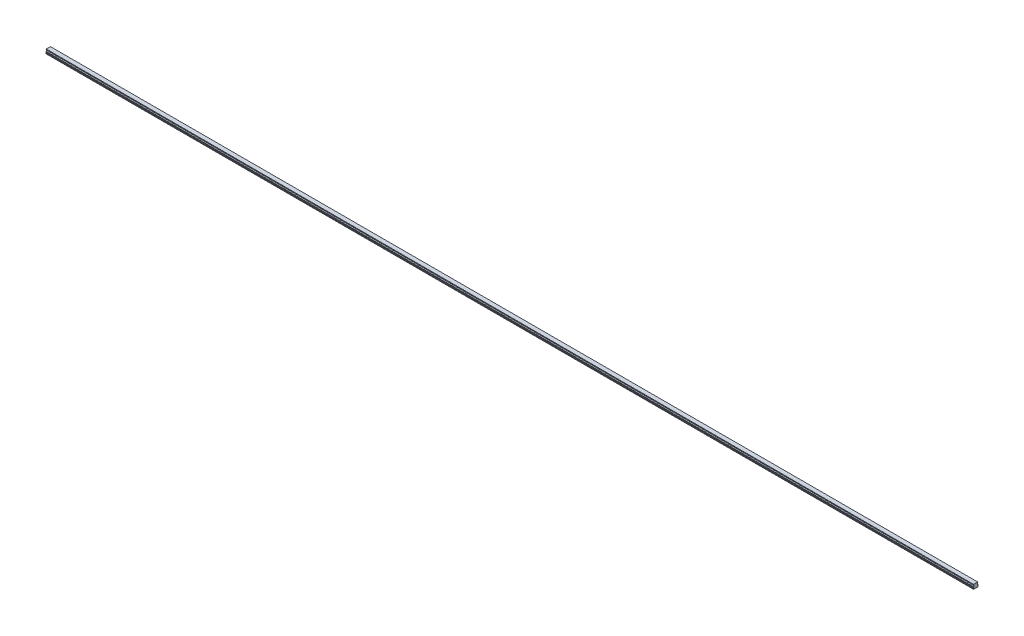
from build123d import *

# Parameters (mm, degrees)
BOSS_EXTRUDE1_DEPTH        = 2940
SKETCH3_R                  = 2.5
SKETCH3_R_2                = 2.1
CUT_EXTRUDE3_DEPTH         = 7
SKETCH3_2_R                = 2.1
CUT_EXTRUDE4_DEPTH         = 9.5
CHAMFER1_SIZE              = 0.4
LPATTERN2_COUNT            = 49
LPATTERN2_PITCH            = 60
CHAMFER1_OF_LPATTERN2_SIZE = 0.4


with BuildPart() as part:
    # Sketch1 → Boss-Extrude1 (new body)
    with BuildSketch(Plane(origin=(0, 0, 0), x_dir=(0, 0, -1), z_dir=(1, 0, 0))):
        with BuildLine():
            Line((6.59, 14), (-6.59, 14))
            Line((-6.59, 14), (-6.59, 13.15))
            Line((-6.59, 13.15), (-6.96, 12.356532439))
            Line((-6.96, 12.356532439), (-6.96, 11.435174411))
            ThreePointArc((-6.96, 11.435174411), (-5.25, 9.5), (-6.96, 7.564825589))
            Line((-6.96, 7.564825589), (-6.96, 6.643467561))
            Line((-6.96, 6.643467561), (-6.59, 5.85))
            Line((-6.59, 5.85), (-7.032116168, 4.2))
            Line((-7.032116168, 4.2), (-7.5, 3.929867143))
            Line((-7.5, 3.929867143), (-7.5, 1.4))
            Line((-7.5, 1.4), (-6.1, 0))
            Line((-6.1, 0), (-3.65, 0))
            Line((-3.65, 0), (-3.25, 0.4))
            Line((-3.25, 0.4), (3.25, 0.4))
            Line((3.25, 0.4), (3.65, 0))
            Line((3.65, 0), (6.1, 0))
            Line((6.1, 0), (7.5, 1.4))
            Line((7.5, 1.4), (7.5, 3.929867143))
            Line((7.5, 3.929867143), (7.032116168, 4.2))
            Line((7.032116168, 4.2), (6.59, 5.85))
            Line((6.59, 5.85), (6.96, 6.643467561))
            Line((6.96, 6.643467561), (6.96, 7.564825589))
            ThreePointArc((6.96, 7.564825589), (5.25, 9.5), (6.96, 11.435174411))
            Line((6.96, 11.435174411), (6.96, 12.356532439))
            Line((6.96, 12.356532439), (6.59, 13.15))
            Line((6.59, 13.15), (6.59, 14))
        make_face()
    extrude(amount=BOSS_EXTRUDE1_DEPTH)

    # Sketch3 → Cut-Extrude3 (cut)
    with BuildSketch(Plane.XZ):
        with Locations(Location((30, 0, 0), (0, 0, 270))):
            Circle(SKETCH3_R)
        with Locations(Location((30, 0, 0), (0, 0, 270))):
            Circle(SKETCH3_R_2, mode=Mode.SUBTRACT)
    cut_extrude3 = extrude(amount=-CUT_EXTRUDE3_DEPTH, mode=Mode.SUBTRACT)

    # Sketch3_2 → Cut-Extrude4 (cut)
    with BuildSketch(Plane.XZ):
        with Locations(Location((30, 0, 0), (0, 0, 270))):
            Circle(SKETCH3_2_R)
    cut_extrude4 = extrude(amount=-CUT_EXTRUDE4_DEPTH, mode=Mode.SUBTRACT)

    # Cut-Extrude5 cone 1 section (on through the dimple's axis) → Cut-Extrude5 (revolve, cut)
    with BuildSketch(Plane(origin=(30, 9.5, 0), x_dir=(0, 0, -1), z_dir=(1, 0, 0))):
        Polygon((0, 0), (2.1, 0), (0, 1.212435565), align=None)
    revolve(axis=Axis((30, 9.5, 0), (0, 1, 0)), mode=Mode.SUBTRACT)

    # Chamfer1
    chamfer1_edges = [part.edges().sort_by_distance(p)[0] for p in [
        (30, 0.4, 2.5),
    ]]
    chamfer(chamfer1_edges, length=CHAMFER1_SIZE)

    # LPattern2: Cut-Extrude3, Cut-Extrude4 ×49
    with Locations(*[(i * LPATTERN2_PITCH, 0, 0) for i in range(1, LPATTERN2_COUNT)]):
        add(cut_extrude3, mode=Mode.SUBTRACT)
        add(cut_extrude4, mode=Mode.SUBTRACT)

    # Chamfer1 of LPattern2
    chamfer1_of_lpattern2_edges = [part.edges().sort_by_distance(p)[0] for p in [
        (90, 0.4, 2.5),
        (150, 0.4, 2.5),
        (210, 0.4, 2.5),
        (270, 0.4, 2.5),
        (330, 0.4, 2.5),
        (390, 0.4, 2.5),
        (450, 0.4, 2.5),
        (510, 0.4, 2.5),
        (570, 0.4, 2.5),
        (630, 0.4, 2.5),
        (690, 0.4, 2.5),
        (750, 0.4, 2.5),
        (810, 0.4, 2.5),
        (870, 0.4, 2.5),
        (930, 0.4, 2.5),
        (990, 0.4, 2.5),
        (1050, 0.4, 2.5),
        (1110, 0.4, 2.5),
        (1170, 0.4, 2.5),
        (1230, 0.4, 2.5),
        (1290, 0.4, 2.5),
        (1350, 0.4, 2.5),
        (1410, 0.4, 2.5),
        (1470, 0.4, 2.5),
        (1530, 0.4, 2.5),
        (1590, 0.4, 2.5),
        (1650, 0.4, 2.5),
        (1710, 0.4, 2.5),
        (1770, 0.4, 2.5),
        (1830, 0.4, 2.5),
        (1890, 0.4, 2.5),
        (1950, 0.4, 2.5),
        (2010, 0.4, 2.5),
        (2070, 0.4, 2.5),
        (2130, 0.4, 2.5),
        (2190, 0.4, 2.5),
        (2250, 0.4, 2.5),
        (2310, 0.4, 2.5),
        (2370, 0.4, 2.5),
        (2430, 0.4, 2.5),
        (2490, 0.4, 2.5),
        (2550, 0.4, 2.5),
        (2610, 0.4, 2.5),
        (2670, 0.4, 2.5),
        (2730, 0.4, 2.5),
        (2790, 0.4, 2.5),
        (2850, 0.4, 2.5),
        (2910, 0.4, 2.5),
    ]]
    chamfer(chamfer1_of_lpattern2_edges, length=CHAMFER1_OF_LPATTERN2_SIZE)


solid = part.part
